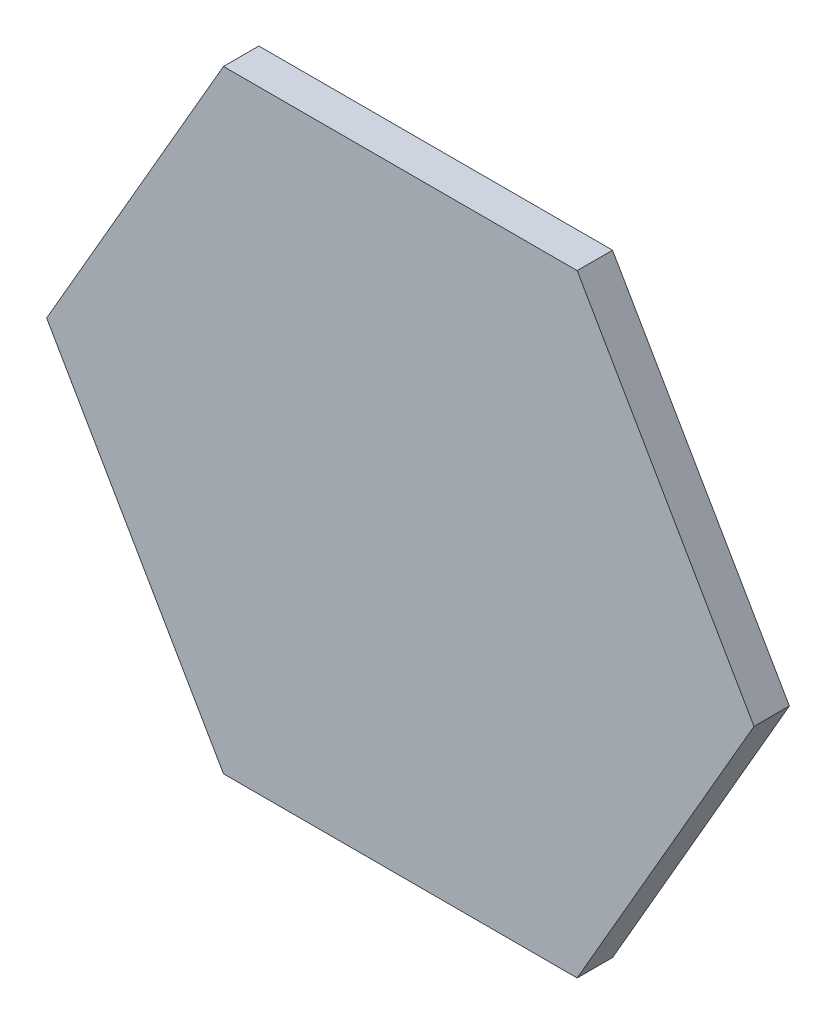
ISO-10303-21;
HEADER;
FILE_DESCRIPTION(('STEP AP214'),'2;1');
FILE_NAME('part.step','',(''),(''),'','','');
FILE_SCHEMA(('AUTOMOTIVE_DESIGN { 1 0 10303 214 1 1 1 1 }'));
ENDSEC;
DATA;
#1=APPLICATION_CONTEXT('core data for automotive mechanical design processes');
#2=APPLICATION_PROTOCOL_DEFINITION('international standard','automotive_design',2000,#1);
#3=PRODUCT_CONTEXT('',#1,'mechanical');
#4=PRODUCT('Part','Part','',(#3));
#5=PRODUCT_RELATED_PRODUCT_CATEGORY('part','',(#4));
#6=PRODUCT_DEFINITION_FORMATION('','',#4);
#7=PRODUCT_DEFINITION_CONTEXT('part definition',#1,'design');
#8=PRODUCT_DEFINITION('design','',#6,#7);
#9=PRODUCT_DEFINITION_SHAPE('','',#8);
#10=(LENGTH_UNIT() NAMED_UNIT(*) SI_UNIT(.MILLI.,.METRE.));
#11=(NAMED_UNIT(*) PLANE_ANGLE_UNIT() SI_UNIT($,.RADIAN.));
#12=(NAMED_UNIT(*) SI_UNIT($,.STERADIAN.) SOLID_ANGLE_UNIT());
#13=UNCERTAINTY_MEASURE_WITH_UNIT(LENGTH_MEASURE(1.E-05),#10,'distance_accuracy_value','');
#14=(GEOMETRIC_REPRESENTATION_CONTEXT(3) GLOBAL_UNCERTAINTY_ASSIGNED_CONTEXT((#13)) GLOBAL_UNIT_ASSIGNED_CONTEXT((#10,
#11,#12)) REPRESENTATION_CONTEXT('',''));
#15=CARTESIAN_POINT('',(0.,0.,0.));
#16=DIRECTION('',(0.,0.,1.));
#17=DIRECTION('',(1.,0.,0.));
#18=AXIS2_PLACEMENT_3D('',#15,#16,#17);
#19=CARTESIAN_POINT('',(12.7,-21.9970452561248,1.27));
#20=DIRECTION('',(-0.866025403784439,0.5,0.));
#21=DIRECTION('',(-0.5,-0.866025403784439,0.));
#22=AXIS2_PLACEMENT_3D('',#19,#20,#21);
#23=PLANE('',#22);
#24=DIRECTION('',(0.5,0.866025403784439,0.));
#25=VECTOR('',#24,1.);
#26=CARTESIAN_POINT('',(12.7,-21.9970452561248,-1.27));
#27=LINE('',#26,#25);
#28=CARTESIAN_POINT('',(12.7,-21.9970452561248,-1.27));
#29=VERTEX_POINT('',#28);
#30=CARTESIAN_POINT('',(25.4,0.,-1.27));
#31=VERTEX_POINT('',#30);
#32=EDGE_CURVE('E117',#29,#31,#27,.T.);
#33=ORIENTED_EDGE('',*,*,#32,.T.);
#34=DIRECTION('',(0.,0.,-1.));
#35=VECTOR('',#34,1.);
#36=CARTESIAN_POINT('',(25.4,0.,1.27));
#37=LINE('',#36,#35);
#38=CARTESIAN_POINT('',(25.4,0.,1.27));
#39=VERTEX_POINT('',#38);
#40=EDGE_CURVE('E11',#39,#31,#37,.T.);
#41=ORIENTED_EDGE('',*,*,#40,.F.);
#42=DIRECTION('',(0.5,0.866025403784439,0.));
#43=VECTOR('',#42,1.);
#44=CARTESIAN_POINT('',(12.7,-21.9970452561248,1.27));
#45=LINE('',#44,#43);
#46=CARTESIAN_POINT('',(12.7,-21.9970452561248,1.27));
#47=VERTEX_POINT('',#46);
#48=EDGE_CURVE('E127',#47,#39,#45,.T.);
#49=ORIENTED_EDGE('',*,*,#48,.F.);
#50=DIRECTION('',(0.,0.,-1.));
#51=VECTOR('',#50,1.);
#52=CARTESIAN_POINT('',(12.7,-21.9970452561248,1.27));
#53=LINE('',#52,#51);
#54=EDGE_CURVE('E113',#47,#29,#53,.T.);
#55=ORIENTED_EDGE('',*,*,#54,.T.);
#56=EDGE_LOOP('',(#33,#41,#49,#55));
#57=FACE_BOUND('',#56,.T.);
#58=ADVANCED_FACE('F33',(#57),#23,.F.);
#59=CARTESIAN_POINT('',(25.4,0.,1.27));
#60=DIRECTION('',(-0.866025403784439,-0.5,0.));
#61=DIRECTION('',(0.5,-0.866025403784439,0.));
#62=AXIS2_PLACEMENT_3D('',#59,#60,#61);
#63=PLANE('',#62);
#64=DIRECTION('',(-0.5,0.866025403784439,0.));
#65=VECTOR('',#64,1.);
#66=CARTESIAN_POINT('',(25.4,0.,-1.27));
#67=LINE('',#66,#65);
#68=CARTESIAN_POINT('',(12.7,21.9970452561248,-1.27));
#69=VERTEX_POINT('',#68);
#70=EDGE_CURVE('E120',#31,#69,#67,.T.);
#71=ORIENTED_EDGE('',*,*,#70,.T.);
#72=DIRECTION('',(0.,0.,-1.));
#73=VECTOR('',#72,1.);
#74=CARTESIAN_POINT('',(12.7,21.9970452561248,1.27));
#75=LINE('',#74,#73);
#76=CARTESIAN_POINT('',(12.7,21.9970452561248,1.27));
#77=VERTEX_POINT('',#76);
#78=EDGE_CURVE('E41',#77,#69,#75,.T.);
#79=ORIENTED_EDGE('',*,*,#78,.F.);
#80=DIRECTION('',(-0.5,0.866025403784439,0.));
#81=VECTOR('',#80,1.);
#82=CARTESIAN_POINT('',(25.4,0.,1.27));
#83=LINE('',#82,#81);
#84=EDGE_CURVE('E86',#39,#77,#83,.T.);
#85=ORIENTED_EDGE('',*,*,#84,.F.);
#86=ORIENTED_EDGE('',*,*,#40,.T.);
#87=EDGE_LOOP('',(#71,#79,#85,#86));
#88=FACE_BOUND('',#87,.T.);
#89=ADVANCED_FACE('F151',(#88),#63,.F.);
#90=CARTESIAN_POINT('',(12.7,21.9970452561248,1.27));
#91=DIRECTION('',(0.,-1.,0.));
#92=DIRECTION('',(0.,0.,-1.));
#93=AXIS2_PLACEMENT_3D('',#90,#91,#92);
#94=PLANE('',#93);
#95=DIRECTION('',(-1.,0.,0.));
#96=VECTOR('',#95,1.);
#97=CARTESIAN_POINT('',(12.7,21.9970452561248,-1.27));
#98=LINE('',#97,#96);
#99=CARTESIAN_POINT('',(-12.7,21.9970452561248,-1.27));
#100=VERTEX_POINT('',#99);
#101=EDGE_CURVE('E122',#69,#100,#98,.T.);
#102=ORIENTED_EDGE('',*,*,#101,.T.);
#103=DIRECTION('',(0.,0.,-1.));
#104=VECTOR('',#103,1.);
#105=CARTESIAN_POINT('',(-12.7,21.9970452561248,1.27));
#106=LINE('',#105,#104);
#107=CARTESIAN_POINT('',(-12.7,21.9970452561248,1.27));
#108=VERTEX_POINT('',#107);
#109=EDGE_CURVE('E108',#108,#100,#106,.T.);
#110=ORIENTED_EDGE('',*,*,#109,.F.);
#111=DIRECTION('',(-1.,0.,0.));
#112=VECTOR('',#111,1.);
#113=CARTESIAN_POINT('',(12.7,21.9970452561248,1.27));
#114=LINE('',#113,#112);
#115=EDGE_CURVE('E99',#77,#108,#114,.T.);
#116=ORIENTED_EDGE('',*,*,#115,.F.);
#117=ORIENTED_EDGE('',*,*,#78,.T.);
#118=EDGE_LOOP('',(#102,#110,#116,#117));
#119=FACE_BOUND('',#118,.T.);
#120=ADVANCED_FACE('F133',(#119),#94,.F.);
#121=CARTESIAN_POINT('',(-12.7,21.9970452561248,1.27));
#122=DIRECTION('',(0.866025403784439,-0.5,0.));
#123=DIRECTION('',(0.5,0.866025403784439,0.));
#124=AXIS2_PLACEMENT_3D('',#121,#122,#123);
#125=PLANE('',#124);
#126=DIRECTION('',(-0.5,-0.866025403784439,0.));
#127=VECTOR('',#126,1.);
#128=CARTESIAN_POINT('',(-12.7,21.9970452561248,-1.27));
#129=LINE('',#128,#127);
#130=CARTESIAN_POINT('',(-25.4,0.,-1.27));
#131=VERTEX_POINT('',#130);
#132=EDGE_CURVE('E107',#100,#131,#129,.T.);
#133=ORIENTED_EDGE('',*,*,#132,.T.);
#134=DIRECTION('',(0.,0.,-1.));
#135=VECTOR('',#134,1.);
#136=CARTESIAN_POINT('',(-25.4,0.,1.27));
#137=LINE('',#136,#135);
#138=CARTESIAN_POINT('',(-25.4,0.,1.27));
#139=VERTEX_POINT('',#138);
#140=EDGE_CURVE('E104',#139,#131,#137,.T.);
#141=ORIENTED_EDGE('',*,*,#140,.F.);
#142=DIRECTION('',(-0.5,-0.866025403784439,0.));
#143=VECTOR('',#142,1.);
#144=CARTESIAN_POINT('',(-12.7,21.9970452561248,1.27));
#145=LINE('',#144,#143);
#146=EDGE_CURVE('E93',#108,#139,#145,.T.);
#147=ORIENTED_EDGE('',*,*,#146,.F.);
#148=ORIENTED_EDGE('',*,*,#109,.T.);
#149=EDGE_LOOP('',(#133,#141,#147,#148));
#150=FACE_BOUND('',#149,.T.);
#151=ADVANCED_FACE('F105',(#150),#125,.F.);
#152=CARTESIAN_POINT('',(-25.4,0.,1.27));
#153=DIRECTION('',(0.866025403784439,0.5,0.));
#154=DIRECTION('',(-0.5,0.866025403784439,0.));
#155=AXIS2_PLACEMENT_3D('',#152,#153,#154);
#156=PLANE('',#155);
#157=DIRECTION('',(0.5,-0.866025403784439,0.));
#158=VECTOR('',#157,1.);
#159=CARTESIAN_POINT('',(-25.4,0.,-1.27));
#160=LINE('',#159,#158);
#161=CARTESIAN_POINT('',(-12.7,-21.9970452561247,-1.27));
#162=VERTEX_POINT('',#161);
#163=EDGE_CURVE('E72',#131,#162,#160,.T.);
#164=ORIENTED_EDGE('',*,*,#163,.T.);
#165=DIRECTION('',(0.,0.,-1.));
#166=VECTOR('',#165,1.);
#167=CARTESIAN_POINT('',(-12.7,-21.9970452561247,1.27));
#168=LINE('',#167,#166);
#169=CARTESIAN_POINT('',(-12.7,-21.9970452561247,1.27));
#170=VERTEX_POINT('',#169);
#171=EDGE_CURVE('E109',#170,#162,#168,.T.);
#172=ORIENTED_EDGE('',*,*,#171,.F.);
#173=DIRECTION('',(0.5,-0.866025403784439,0.));
#174=VECTOR('',#173,1.);
#175=CARTESIAN_POINT('',(-25.4,0.,1.27));
#176=LINE('',#175,#174);
#177=EDGE_CURVE('E97',#139,#170,#176,.T.);
#178=ORIENTED_EDGE('',*,*,#177,.F.);
#179=ORIENTED_EDGE('',*,*,#140,.T.);
#180=EDGE_LOOP('',(#164,#172,#178,#179));
#181=FACE_BOUND('',#180,.T.);
#182=ADVANCED_FACE('F111',(#181),#156,.F.);
#183=CARTESIAN_POINT('',(-12.7,-21.9970452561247,1.27));
#184=DIRECTION('',(0.,1.,0.));
#185=DIRECTION('',(-1.,0.,0.));
#186=AXIS2_PLACEMENT_3D('',#183,#184,#185);
#187=PLANE('',#186);
#188=DIRECTION('',(1.,0.,0.));
#189=VECTOR('',#188,1.);
#190=CARTESIAN_POINT('',(-12.7,-21.9970452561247,-1.27));
#191=LINE('',#190,#189);
#192=EDGE_CURVE('E78',#162,#29,#191,.T.);
#193=ORIENTED_EDGE('',*,*,#192,.T.);
#194=ORIENTED_EDGE('',*,*,#54,.F.);
#195=DIRECTION('',(1.,0.,0.));
#196=VECTOR('',#195,1.);
#197=CARTESIAN_POINT('',(-12.7,-21.9970452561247,1.27));
#198=LINE('',#197,#196);
#199=EDGE_CURVE('E49',#170,#47,#198,.T.);
#200=ORIENTED_EDGE('',*,*,#199,.F.);
#201=ORIENTED_EDGE('',*,*,#171,.T.);
#202=EDGE_LOOP('',(#193,#194,#200,#201));
#203=FACE_BOUND('',#202,.T.);
#204=ADVANCED_FACE('F140',(#203),#187,.F.);
#205=CARTESIAN_POINT('',(25.4,0.,1.27));
#206=DIRECTION('',(0.,0.,1.));
#207=DIRECTION('',(1.,0.,0.));
#208=AXIS2_PLACEMENT_3D('',#205,#206,#207);
#209=PLANE('',#208);
#210=ORIENTED_EDGE('',*,*,#48,.T.);
#211=ORIENTED_EDGE('',*,*,#84,.T.);
#212=ORIENTED_EDGE('',*,*,#115,.T.);
#213=ORIENTED_EDGE('',*,*,#146,.T.);
#214=ORIENTED_EDGE('',*,*,#177,.T.);
#215=ORIENTED_EDGE('',*,*,#199,.T.);
#216=EDGE_LOOP('',(#210,#211,#212,#213,#214,#215));
#217=FACE_BOUND('',#216,.T.);
#218=ADVANCED_FACE('F95',(#217),#209,.T.);
#219=CARTESIAN_POINT('',(25.4,0.,-1.27));
#220=DIRECTION('',(0.,0.,1.));
#221=DIRECTION('',(1.,0.,0.));
#222=AXIS2_PLACEMENT_3D('',#219,#220,#221);
#223=PLANE('',#222);
#224=ORIENTED_EDGE('',*,*,#32,.F.);
#225=ORIENTED_EDGE('',*,*,#192,.F.);
#226=ORIENTED_EDGE('',*,*,#163,.F.);
#227=ORIENTED_EDGE('',*,*,#132,.F.);
#228=ORIENTED_EDGE('',*,*,#101,.F.);
#229=ORIENTED_EDGE('',*,*,#70,.F.);
#230=EDGE_LOOP('',(#224,#225,#226,#227,#228,#229));
#231=FACE_BOUND('',#230,.T.);
#232=ADVANCED_FACE('F136',(#231),#223,.F.);
#233=CLOSED_SHELL('',(#58,#89,#120,#151,#182,#204,#218,#232));
#234=MANIFOLD_SOLID_BREP('B2',#233);
#235=ADVANCED_BREP_SHAPE_REPRESENTATION('',(#18,#234),#14);
#236=SHAPE_DEFINITION_REPRESENTATION(#9,#235);
ENDSEC;
END-ISO-10303-21;
